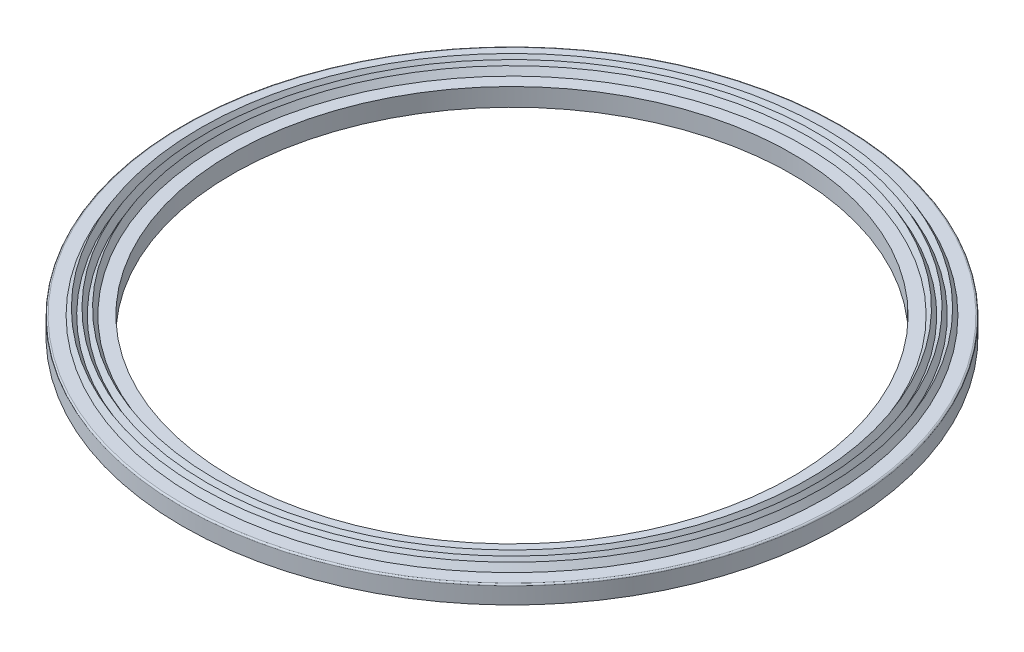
from build123d import *


with BuildPart() as part:
    # Esquisse1 → R_volution1 (revolve)
    with BuildSketch(Plane.XY, mode=Mode.PRIVATE) as r_volution1_sk:
        with BuildLine():
            Line((-93.5, 55.982480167), (-97.75, 55.982480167))
            Line((-97.75, 55.982480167), (-99, 58.112480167))
            Line((-99, 58.112480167), (-100.25, 55.982480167))
            Line((-100.25, 55.982480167), (-101.5, 58.112480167))
            Line((-101.5, 58.112480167), (-102.75, 55.982480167))
            Line((-102.75, 55.982480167), (-104, 58.112480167))
            Line((-104, 58.112480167), (-105.25, 55.982480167))
            Line((-105.25, 55.982480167), (-109.5, 55.982480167))
            ThreePointArc((-109.5, 55.982480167), (-109.853553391, 55.836033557), (-110, 55.482480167))
            Line((-110, 55.482480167), (-110, 49.982480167))
            Line((-110, 49.982480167), (-109, 49.982480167))
            Line((-109, 49.982480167), (-109, 53.982480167))
            Line((-109, 53.982480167), (-95.5, 53.982480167))
            Line((-95.5, 53.982480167), (-95.5, 49.982480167))
            Line((-95.5, 49.982480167), (-93.5, 49.982480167))
            Line((-93.5, 49.982480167), (-93.5, 53.982480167))
            Line((-93.5, 53.982480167), (-93.5, 55.982480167))
        make_face()
    revolve(r_volution1_sk.sketch.rotate(Axis((0, 87.648755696, 0), (0, -1, 0)), 270), axis=Axis((0, 87.648755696, 0), (0, -1, 0)))


solid = part.part
